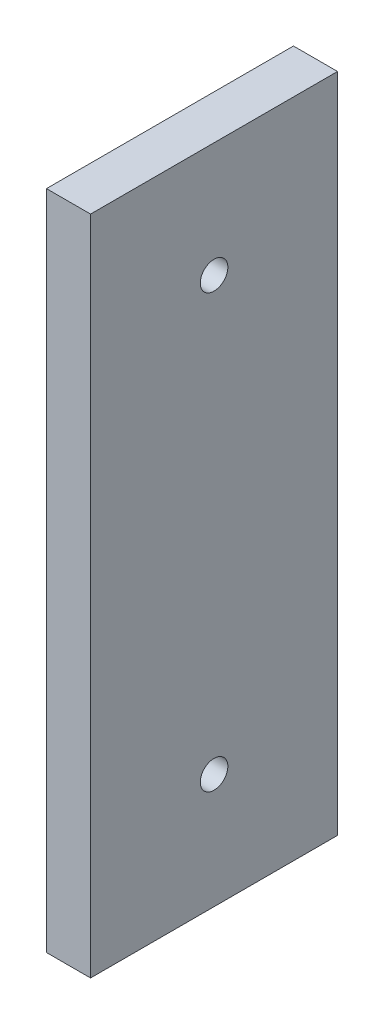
ISO-10303-21;
HEADER;
FILE_DESCRIPTION(('STEP AP214'),'2;1');
FILE_NAME('part.step','',(''),(''),'','','');
FILE_SCHEMA(('AUTOMOTIVE_DESIGN { 1 0 10303 214 1 1 1 1 }'));
ENDSEC;
DATA;
#1=APPLICATION_CONTEXT('core data for automotive mechanical design processes');
#2=APPLICATION_PROTOCOL_DEFINITION('international standard','automotive_design',2000,#1);
#3=PRODUCT_CONTEXT('',#1,'mechanical');
#4=PRODUCT('Part','Part','',(#3));
#5=PRODUCT_RELATED_PRODUCT_CATEGORY('part','',(#4));
#6=PRODUCT_DEFINITION_FORMATION('','',#4);
#7=PRODUCT_DEFINITION_CONTEXT('part definition',#1,'design');
#8=PRODUCT_DEFINITION('design','',#6,#7);
#9=PRODUCT_DEFINITION_SHAPE('','',#8);
#10=(LENGTH_UNIT() NAMED_UNIT(*) SI_UNIT(.MILLI.,.METRE.));
#11=(NAMED_UNIT(*) PLANE_ANGLE_UNIT() SI_UNIT($,.RADIAN.));
#12=(NAMED_UNIT(*) SI_UNIT($,.STERADIAN.) SOLID_ANGLE_UNIT());
#13=UNCERTAINTY_MEASURE_WITH_UNIT(LENGTH_MEASURE(1.E-05),#10,'distance_accuracy_value','');
#14=(GEOMETRIC_REPRESENTATION_CONTEXT(3) GLOBAL_UNCERTAINTY_ASSIGNED_CONTEXT((#13)) GLOBAL_UNIT_ASSIGNED_CONTEXT((#10,
#11,#12)) REPRESENTATION_CONTEXT('',''));
#15=CARTESIAN_POINT('',(0.,0.,0.));
#16=DIRECTION('',(0.,0.,1.));
#17=DIRECTION('',(1.,0.,0.));
#18=AXIS2_PLACEMENT_3D('',#15,#16,#17);
#19=CARTESIAN_POINT('',(6.35,47.625,-17.78));
#20=DIRECTION('',(0.,0.,1.));
#21=DIRECTION('',(0.,-1.,0.));
#22=AXIS2_PLACEMENT_3D('',#19,#20,#21);
#23=PLANE('',#22);
#24=DIRECTION('',(0.,1.,0.));
#25=VECTOR('',#24,1.);
#26=CARTESIAN_POINT('',(0.,47.625,-17.78));
#27=LINE('',#26,#25);
#28=CARTESIAN_POINT('',(0.,-47.625,-17.78));
#29=VERTEX_POINT('',#28);
#30=CARTESIAN_POINT('',(0.,47.625,-17.78));
#31=VERTEX_POINT('',#30);
#32=EDGE_CURVE('E96',#29,#31,#27,.T.);
#33=ORIENTED_EDGE('',*,*,#32,.T.);
#34=DIRECTION('',(-1.,0.,0.));
#35=VECTOR('',#34,1.);
#36=CARTESIAN_POINT('',(6.35,47.625,-17.78));
#37=LINE('',#36,#35);
#38=CARTESIAN_POINT('',(6.35,47.625,-17.78));
#39=VERTEX_POINT('',#38);
#40=EDGE_CURVE('E11',#39,#31,#37,.T.);
#41=ORIENTED_EDGE('',*,*,#40,.F.);
#42=DIRECTION('',(0.,1.,0.));
#43=VECTOR('',#42,1.);
#44=CARTESIAN_POINT('',(6.35,47.625,-17.78));
#45=LINE('',#44,#43);
#46=CARTESIAN_POINT('',(6.35,-47.625,-17.78));
#47=VERTEX_POINT('',#46);
#48=EDGE_CURVE('E83',#47,#39,#45,.T.);
#49=ORIENTED_EDGE('',*,*,#48,.F.);
#50=DIRECTION('',(-1.,0.,0.));
#51=VECTOR('',#50,1.);
#52=CARTESIAN_POINT('',(6.35,-47.625,-17.78));
#53=LINE('',#52,#51);
#54=EDGE_CURVE('E92',#47,#29,#53,.T.);
#55=ORIENTED_EDGE('',*,*,#54,.T.);
#56=EDGE_LOOP('',(#33,#41,#49,#55));
#57=FACE_BOUND('',#56,.T.);
#58=ADVANCED_FACE('F31',(#57),#23,.F.);
#59=CARTESIAN_POINT('',(6.35,47.625,17.78));
#60=DIRECTION('',(0.,-1.,0.));
#61=DIRECTION('',(0.,0.,-1.));
#62=AXIS2_PLACEMENT_3D('',#59,#60,#61);
#63=PLANE('',#62);
#64=DIRECTION('',(0.,0.,1.));
#65=VECTOR('',#64,1.);
#66=CARTESIAN_POINT('',(0.,47.625,17.78));
#67=LINE('',#66,#65);
#68=CARTESIAN_POINT('',(0.,47.625,17.78));
#69=VERTEX_POINT('',#68);
#70=EDGE_CURVE('E87',#31,#69,#67,.T.);
#71=ORIENTED_EDGE('',*,*,#70,.T.);
#72=DIRECTION('',(-1.,0.,0.));
#73=VECTOR('',#72,1.);
#74=CARTESIAN_POINT('',(6.35,47.625,17.78));
#75=LINE('',#74,#73);
#76=CARTESIAN_POINT('',(6.35,47.625,17.78));
#77=VERTEX_POINT('',#76);
#78=EDGE_CURVE('E40',#77,#69,#75,.T.);
#79=ORIENTED_EDGE('',*,*,#78,.F.);
#80=DIRECTION('',(0.,0.,1.));
#81=VECTOR('',#80,1.);
#82=CARTESIAN_POINT('',(6.35,47.625,17.78));
#83=LINE('',#82,#81);
#84=EDGE_CURVE('E78',#39,#77,#83,.T.);
#85=ORIENTED_EDGE('',*,*,#84,.F.);
#86=ORIENTED_EDGE('',*,*,#40,.T.);
#87=EDGE_LOOP('',(#71,#79,#85,#86));
#88=FACE_BOUND('',#87,.T.);
#89=ADVANCED_FACE('F86',(#88),#63,.F.);
#90=CARTESIAN_POINT('',(6.35,47.625,17.78));
#91=DIRECTION('',(0.,0.,-1.));
#92=DIRECTION('',(0.,1.,0.));
#93=AXIS2_PLACEMENT_3D('',#90,#91,#92);
#94=PLANE('',#93);
#95=DIRECTION('',(0.,-1.,0.));
#96=VECTOR('',#95,1.);
#97=CARTESIAN_POINT('',(0.,47.625,17.78));
#98=LINE('',#97,#96);
#99=CARTESIAN_POINT('',(0.,-47.625,17.78));
#100=VERTEX_POINT('',#99);
#101=EDGE_CURVE('E65',#69,#100,#98,.T.);
#102=ORIENTED_EDGE('',*,*,#101,.T.);
#103=DIRECTION('',(-1.,0.,0.));
#104=VECTOR('',#103,1.);
#105=CARTESIAN_POINT('',(6.35,-47.625,17.78));
#106=LINE('',#105,#104);
#107=CARTESIAN_POINT('',(6.35,-47.625,17.78));
#108=VERTEX_POINT('',#107);
#109=EDGE_CURVE('E88',#108,#100,#106,.T.);
#110=ORIENTED_EDGE('',*,*,#109,.F.);
#111=DIRECTION('',(0.,-1.,0.));
#112=VECTOR('',#111,1.);
#113=CARTESIAN_POINT('',(6.35,47.625,17.78));
#114=LINE('',#113,#112);
#115=EDGE_CURVE('E81',#77,#108,#114,.T.);
#116=ORIENTED_EDGE('',*,*,#115,.F.);
#117=ORIENTED_EDGE('',*,*,#78,.T.);
#118=EDGE_LOOP('',(#102,#110,#116,#117));
#119=FACE_BOUND('',#118,.T.);
#120=ADVANCED_FACE('F90',(#119),#94,.F.);
#121=CARTESIAN_POINT('',(6.35,-47.625,17.78));
#122=DIRECTION('',(0.,1.,0.));
#123=DIRECTION('',(0.,0.,1.));
#124=AXIS2_PLACEMENT_3D('',#121,#122,#123);
#125=PLANE('',#124);
#126=DIRECTION('',(0.,0.,-1.));
#127=VECTOR('',#126,1.);
#128=CARTESIAN_POINT('',(0.,-47.625,17.78));
#129=LINE('',#128,#127);
#130=EDGE_CURVE('E71',#100,#29,#129,.T.);
#131=ORIENTED_EDGE('',*,*,#130,.T.);
#132=ORIENTED_EDGE('',*,*,#54,.F.);
#133=DIRECTION('',(0.,0.,-1.));
#134=VECTOR('',#133,1.);
#135=CARTESIAN_POINT('',(6.35,-47.625,17.78));
#136=LINE('',#135,#134);
#137=EDGE_CURVE('E48',#108,#47,#136,.T.);
#138=ORIENTED_EDGE('',*,*,#137,.F.);
#139=ORIENTED_EDGE('',*,*,#109,.T.);
#140=EDGE_LOOP('',(#131,#132,#138,#139));
#141=FACE_BOUND('',#140,.T.);
#142=ADVANCED_FACE('F104',(#141),#125,.F.);
#143=CARTESIAN_POINT('',(6.35,-47.625,-17.78));
#144=DIRECTION('',(1.,0.,0.));
#145=DIRECTION('',(0.,0.,-1.));
#146=AXIS2_PLACEMENT_3D('',#143,#144,#145);
#147=PLANE('',#146);
#148=CARTESIAN_POINT('',(6.35,-31.115,0.));
#149=DIRECTION('',(1.,0.,0.));
#150=DIRECTION('',(0.,0.,-1.));
#151=AXIS2_PLACEMENT_3D('',#148,#149,#150);
#152=CIRCLE('',#151,1.98437499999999);
#153=CARTESIAN_POINT('',(6.35,-31.115,-1.98437499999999));
#154=VERTEX_POINT('',#153);
#155=EDGE_CURVE('E34',#154,#154,#152,.T.);
#156=ORIENTED_EDGE('',*,*,#155,.F.);
#157=EDGE_LOOP('',(#156));
#158=FACE_BOUND('',#157,.T.);
#159=CARTESIAN_POINT('',(6.35,31.115,0.));
#160=DIRECTION('',(1.,0.,0.));
#161=DIRECTION('',(0.,0.,-1.));
#162=AXIS2_PLACEMENT_3D('',#159,#160,#161);
#163=CIRCLE('',#162,1.984375);
#164=CARTESIAN_POINT('',(6.35,31.115,-1.984375));
#165=VERTEX_POINT('',#164);
#166=EDGE_CURVE('E99',#165,#165,#163,.T.);
#167=ORIENTED_EDGE('',*,*,#166,.F.);
#168=EDGE_LOOP('',(#167));
#169=FACE_BOUND('',#168,.T.);
#170=ORIENTED_EDGE('',*,*,#48,.T.);
#171=ORIENTED_EDGE('',*,*,#84,.T.);
#172=ORIENTED_EDGE('',*,*,#115,.T.);
#173=ORIENTED_EDGE('',*,*,#137,.T.);
#174=EDGE_LOOP('',(#170,#171,#172,#173));
#175=FACE_BOUND('',#174,.T.);
#176=ADVANCED_FACE('F79',(#158,#169,#175),#147,.T.);
#177=CARTESIAN_POINT('',(0.,-47.625,-17.78));
#178=DIRECTION('',(1.,0.,0.));
#179=DIRECTION('',(0.,0.,-1.));
#180=AXIS2_PLACEMENT_3D('',#177,#178,#179);
#181=PLANE('',#180);
#182=CARTESIAN_POINT('',(0.,-31.115,0.));
#183=DIRECTION('',(-1.,0.,0.));
#184=DIRECTION('',(0.,0.,1.));
#185=AXIS2_PLACEMENT_3D('',#182,#183,#184);
#186=CIRCLE('',#185,1.984375);
#187=CARTESIAN_POINT('',(0.,-31.115,1.984375));
#188=VERTEX_POINT('',#187);
#189=EDGE_CURVE('E115',#188,#188,#186,.T.);
#190=ORIENTED_EDGE('',*,*,#189,.F.);
#191=EDGE_LOOP('',(#190));
#192=FACE_BOUND('',#191,.T.);
#193=CARTESIAN_POINT('',(0.,31.115,0.));
#194=DIRECTION('',(-1.,0.,0.));
#195=DIRECTION('',(0.,0.,1.));
#196=AXIS2_PLACEMENT_3D('',#193,#194,#195);
#197=CIRCLE('',#196,1.984375);
#198=CARTESIAN_POINT('',(0.,31.115,1.984375));
#199=VERTEX_POINT('',#198);
#200=EDGE_CURVE('E112',#199,#199,#197,.T.);
#201=ORIENTED_EDGE('',*,*,#200,.F.);
#202=EDGE_LOOP('',(#201));
#203=FACE_BOUND('',#202,.T.);
#204=ORIENTED_EDGE('',*,*,#32,.F.);
#205=ORIENTED_EDGE('',*,*,#130,.F.);
#206=ORIENTED_EDGE('',*,*,#101,.F.);
#207=ORIENTED_EDGE('',*,*,#70,.F.);
#208=EDGE_LOOP('',(#204,#205,#206,#207));
#209=FACE_BOUND('',#208,.T.);
#210=ADVANCED_FACE('F107',(#192,#203,#209),#181,.F.);
#211=CARTESIAN_POINT('',(0.,31.115,0.));
#212=DIRECTION('',(-1.,0.,0.));
#213=DIRECTION('',(0.,0.,1.));
#214=AXIS2_PLACEMENT_3D('',#211,#212,#213);
#215=CYLINDRICAL_SURFACE('',#214,1.984375);
#216=ORIENTED_EDGE('',*,*,#166,.T.);
#217=EDGE_LOOP('',(#216));
#218=FACE_BOUND('',#217,.T.);
#219=ORIENTED_EDGE('',*,*,#200,.T.);
#220=EDGE_LOOP('',(#219));
#221=FACE_BOUND('',#220,.T.);
#222=ADVANCED_FACE('F129',(#218,#221),#215,.F.);
#223=CARTESIAN_POINT('',(0.,-31.115,0.));
#224=DIRECTION('',(-1.,0.,0.));
#225=DIRECTION('',(0.,0.,1.));
#226=AXIS2_PLACEMENT_3D('',#223,#224,#225);
#227=CYLINDRICAL_SURFACE('',#226,1.98437499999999);
#228=ORIENTED_EDGE('',*,*,#155,.T.);
#229=EDGE_LOOP('',(#228));
#230=FACE_BOUND('',#229,.T.);
#231=ORIENTED_EDGE('',*,*,#189,.T.);
#232=EDGE_LOOP('',(#231));
#233=FACE_BOUND('',#232,.T.);
#234=ADVANCED_FACE('F122',(#230,#233),#227,.F.);
#235=CLOSED_SHELL('',(#58,#89,#120,#142,#176,#210,#222,#234));
#236=MANIFOLD_SOLID_BREP('B2',#235);
#237=ADVANCED_BREP_SHAPE_REPRESENTATION('',(#18,#236),#14);
#238=SHAPE_DEFINITION_REPRESENTATION(#9,#237);
ENDSEC;
END-ISO-10303-21;
